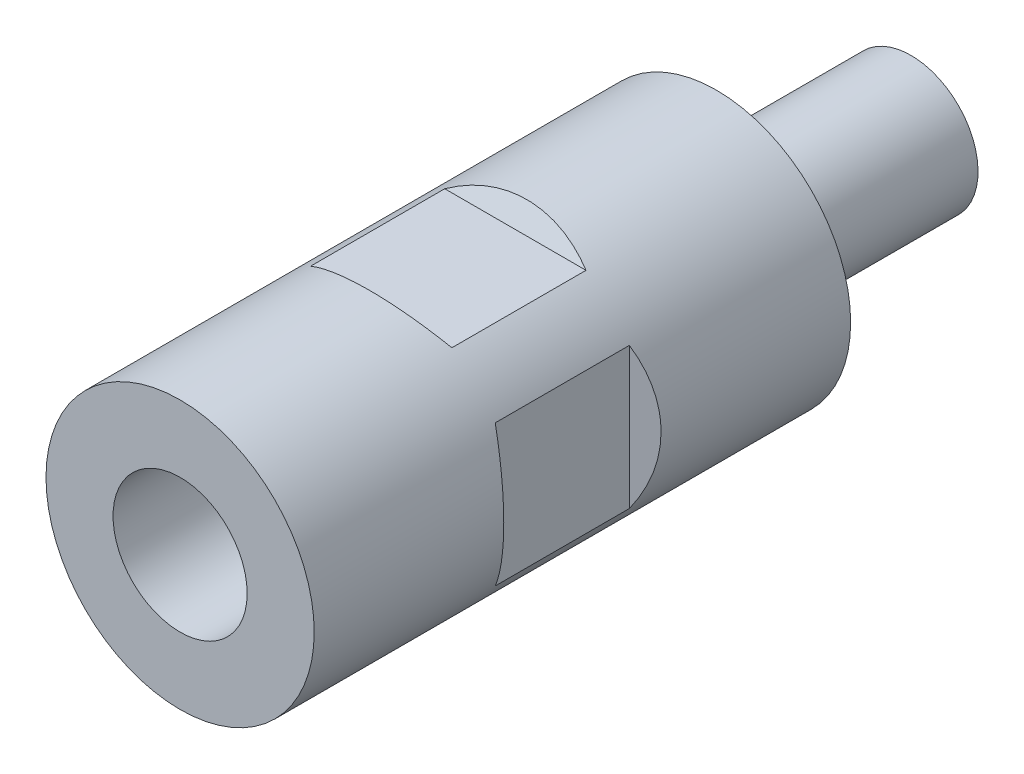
ISO-10303-21;
HEADER;
FILE_DESCRIPTION(('STEP AP214'),'2;1');
FILE_NAME('part.step','',(''),(''),'','','');
FILE_SCHEMA(('AUTOMOTIVE_DESIGN { 1 0 10303 214 1 1 1 1 }'));
ENDSEC;
DATA;
#1=APPLICATION_CONTEXT('core data for automotive mechanical design processes');
#2=APPLICATION_PROTOCOL_DEFINITION('international standard','automotive_design',2000,#1);
#3=PRODUCT_CONTEXT('',#1,'mechanical');
#4=PRODUCT('Part','Part','',(#3));
#5=PRODUCT_RELATED_PRODUCT_CATEGORY('part','',(#4));
#6=PRODUCT_DEFINITION_FORMATION('','',#4);
#7=PRODUCT_DEFINITION_CONTEXT('part definition',#1,'design');
#8=PRODUCT_DEFINITION('design','',#6,#7);
#9=PRODUCT_DEFINITION_SHAPE('','',#8);
#10=(LENGTH_UNIT() NAMED_UNIT(*) SI_UNIT(.MILLI.,.METRE.));
#11=(NAMED_UNIT(*) PLANE_ANGLE_UNIT() SI_UNIT($,.RADIAN.));
#12=(NAMED_UNIT(*) SI_UNIT($,.STERADIAN.) SOLID_ANGLE_UNIT());
#13=UNCERTAINTY_MEASURE_WITH_UNIT(LENGTH_MEASURE(1.E-05),#10,'distance_accuracy_value','');
#14=(GEOMETRIC_REPRESENTATION_CONTEXT(3) GLOBAL_UNCERTAINTY_ASSIGNED_CONTEXT((#13)) GLOBAL_UNIT_ASSIGNED_CONTEXT((#10,
#11,#12)) REPRESENTATION_CONTEXT('',''));
#15=CARTESIAN_POINT('',(0.,0.,0.));
#16=DIRECTION('',(0.,0.,1.));
#17=DIRECTION('',(1.,0.,0.));
#18=AXIS2_PLACEMENT_3D('',#15,#16,#17);
#19=CARTESIAN_POINT('',(0.,0.,-14.5));
#20=DIRECTION('',(0.,0.,1.));
#21=DIRECTION('',(0.,-1.,0.));
#22=AXIS2_PLACEMENT_3D('',#19,#20,#21);
#23=PLANE('',#22);
#24=CARTESIAN_POINT('',(0.,0.,-14.5));
#25=DIRECTION('',(0.,0.,1.));
#26=DIRECTION('',(0.,-1.,0.));
#27=AXIS2_PLACEMENT_3D('',#24,#25,#26);
#28=CIRCLE('',#27,5.);
#29=CARTESIAN_POINT('',(0.,-5.,-14.5));
#30=VERTEX_POINT('',#29);
#31=EDGE_CURVE('E103',#30,#30,#28,.F.);
#32=ORIENTED_EDGE('',*,*,#31,.T.);
#33=EDGE_LOOP('',(#32));
#34=FACE_BOUND('',#33,.T.);
#35=ADVANCED_FACE('F14',(#34),#23,.F.);
#36=CARTESIAN_POINT('',(0.,0.,5.5));
#37=DIRECTION('',(0.,0.,1.));
#38=DIRECTION('',(0.,-1.,0.));
#39=AXIS2_PLACEMENT_3D('',#36,#37,#38);
#40=CYLINDRICAL_SURFACE('',#39,5.);
#41=ORIENTED_EDGE('',*,*,#31,.F.);
#42=EDGE_LOOP('',(#41));
#43=FACE_BOUND('',#42,.T.);
#44=CARTESIAN_POINT('',(0.,4.36432032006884E-13,0.));
#45=DIRECTION('',(0.,0.,1.));
#46=DIRECTION('',(1.,0.,0.));
#47=AXIS2_PLACEMENT_3D('',#44,#45,#46);
#48=CIRCLE('',#47,5.);
#49=CARTESIAN_POINT('',(5.,4.36432032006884E-13,0.));
#50=VERTEX_POINT('',#49);
#51=EDGE_CURVE('E9',#50,#50,#48,.T.);
#52=ORIENTED_EDGE('',*,*,#51,.F.);
#53=EDGE_LOOP('',(#52));
#54=FACE_BOUND('',#53,.T.);
#55=ADVANCED_FACE('F339',(#43,#54),#40,.T.);
#56=CARTESIAN_POINT('',(0.,-5.,15.5));
#57=DIRECTION('',(0.,0.,-1.));
#58=DIRECTION('',(0.,1.,0.));
#59=AXIS2_PLACEMENT_3D('',#56,#57,#58);
#60=PLANE('',#59);
#61=CARTESIAN_POINT('',(0.,0.,15.5));
#62=DIRECTION('',(0.,0.,1.));
#63=DIRECTION('',(0.,-1.,0.));
#64=AXIS2_PLACEMENT_3D('',#61,#62,#63);
#65=CIRCLE('',#64,5.);
#66=CARTESIAN_POINT('',(0.,-5.,15.5));
#67=VERTEX_POINT('',#66);
#68=EDGE_CURVE('E17',#67,#67,#65,.T.);
#69=ORIENTED_EDGE('',*,*,#68,.T.);
#70=EDGE_LOOP('',(#69));
#71=FACE_BOUND('',#70,.T.);
#72=ADVANCED_FACE('F112',(#71),#60,.F.);
#73=CARTESIAN_POINT('',(8.5,-10.,25.));
#74=DIRECTION('',(-0.5,0.,0.86602540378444));
#75=DIRECTION('',(0.86602540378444,0.,0.5));
#76=AXIS2_PLACEMENT_3D('',#73,#74,#75);
#77=PLANE('',#76);
#78=DIRECTION('',(0.,1.,0.));
#79=VECTOR('',#78,1.);
#80=CARTESIAN_POINT('',(8.5,-10.,25.));
#81=LINE('',#80,#79);
#82=CARTESIAN_POINT('',(8.5,-5.26782687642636,25.));
#83=VERTEX_POINT('',#82);
#84=CARTESIAN_POINT('',(8.5,5.26782687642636,25.));
#85=VERTEX_POINT('',#84);
#86=EDGE_CURVE('E138',#83,#85,#81,.T.);
#87=ORIENTED_EDGE('',*,*,#86,.T.);
#88=CARTESIAN_POINT('',(0.,0.,20.0925227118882));
#89=DIRECTION('',(-0.5,0.,0.86602540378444));
#90=DIRECTION('',(-0.86602540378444,0.,-0.5));
#91=AXIS2_PLACEMENT_3D('',#88,#89,#90);
#92=ELLIPSE('',#91,11.5470053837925,10.);
#93=EDGE_CURVE('E35',#83,#85,#92,.T.);
#94=ORIENTED_EDGE('',*,*,#93,.F.);
#95=EDGE_LOOP('',(#87,#94));
#96=FACE_BOUND('',#95,.T.);
#97=ADVANCED_FACE('F204',(#96),#77,.F.);
#98=CARTESIAN_POINT('',(8.5,-10.,25.));
#99=DIRECTION('',(-1.,0.,0.));
#100=DIRECTION('',(0.,0.,1.));
#101=AXIS2_PLACEMENT_3D('',#98,#99,#100);
#102=PLANE('',#101);
#103=ORIENTED_EDGE('',*,*,#86,.F.);
#104=DIRECTION('',(0.,0.,-1.));
#105=VECTOR('',#104,1.);
#106=CARTESIAN_POINT('',(8.5,-5.26782687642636,40.));
#107=LINE('',#106,#105);
#108=CARTESIAN_POINT('',(8.5,-5.26782687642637,15.));
#109=VERTEX_POINT('',#108);
#110=EDGE_CURVE('E151',#109,#83,#107,.F.);
#111=ORIENTED_EDGE('',*,*,#110,.F.);
#112=DIRECTION('',(0.,1.,0.));
#113=VECTOR('',#112,1.);
#114=CARTESIAN_POINT('',(8.5,-10.,15.));
#115=LINE('',#114,#113);
#116=CARTESIAN_POINT('',(8.5,5.26782687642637,15.));
#117=VERTEX_POINT('',#116);
#118=EDGE_CURVE('E135',#109,#117,#115,.T.);
#119=ORIENTED_EDGE('',*,*,#118,.T.);
#120=DIRECTION('',(0.,0.,-1.));
#121=VECTOR('',#120,1.);
#122=CARTESIAN_POINT('',(8.5,5.26782687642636,40.));
#123=LINE('',#122,#121);
#124=EDGE_CURVE('E29',#85,#117,#123,.T.);
#125=ORIENTED_EDGE('',*,*,#124,.F.);
#126=EDGE_LOOP('',(#103,#111,#119,#125));
#127=FACE_BOUND('',#126,.T.);
#128=ADVANCED_FACE('F214',(#127),#102,.F.);
#129=CARTESIAN_POINT('',(8.5,-10.,15.));
#130=DIRECTION('',(-0.5,0.,-0.866025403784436));
#131=DIRECTION('',(-0.866025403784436,0.,0.5));
#132=AXIS2_PLACEMENT_3D('',#129,#130,#131);
#133=PLANE('',#132);
#134=CARTESIAN_POINT('',(0.,0.,19.9074772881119));
#135=DIRECTION('',(-0.5,0.,-0.866025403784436));
#136=DIRECTION('',(0.866025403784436,0.,-0.5));
#137=AXIS2_PLACEMENT_3D('',#134,#135,#136);
#138=ELLIPSE('',#137,11.5470053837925,10.);
#139=EDGE_CURVE('E147',#117,#109,#138,.T.);
#140=ORIENTED_EDGE('',*,*,#139,.F.);
#141=ORIENTED_EDGE('',*,*,#118,.F.);
#142=EDGE_LOOP('',(#140,#141));
#143=FACE_BOUND('',#142,.T.);
#144=ADVANCED_FACE('F215',(#143),#133,.F.);
#145=CARTESIAN_POINT('',(-8.5,-10.,15.));
#146=DIRECTION('',(0.5,0.,-0.866025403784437));
#147=DIRECTION('',(-0.866025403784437,0.,-0.5));
#148=AXIS2_PLACEMENT_3D('',#145,#146,#147);
#149=PLANE('',#148);
#150=CARTESIAN_POINT('',(0.,0.,19.9074772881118));
#151=DIRECTION('',(0.5,0.,-0.866025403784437));
#152=DIRECTION('',(-0.866025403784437,0.,-0.5));
#153=AXIS2_PLACEMENT_3D('',#150,#151,#152);
#154=ELLIPSE('',#153,11.5470053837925,10.);
#155=CARTESIAN_POINT('',(-8.5,-5.26782687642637,15.));
#156=VERTEX_POINT('',#155);
#157=CARTESIAN_POINT('',(-8.5,5.26782687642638,15.));
#158=VERTEX_POINT('',#157);
#159=EDGE_CURVE('E154',#156,#158,#154,.T.);
#160=ORIENTED_EDGE('',*,*,#159,.F.);
#161=DIRECTION('',(0.,1.,0.));
#162=VECTOR('',#161,1.);
#163=CARTESIAN_POINT('',(-8.5,-10.,15.));
#164=LINE('',#163,#162);
#165=EDGE_CURVE('E129',#156,#158,#164,.T.);
#166=ORIENTED_EDGE('',*,*,#165,.T.);
#167=EDGE_LOOP('',(#160,#166));
#168=FACE_BOUND('',#167,.T.);
#169=ADVANCED_FACE('F218',(#168),#149,.F.);
#170=CARTESIAN_POINT('',(-8.5,-10.,25.));
#171=DIRECTION('',(0.5,0.,0.86602540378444));
#172=DIRECTION('',(0.86602540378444,0.,-0.5));
#173=AXIS2_PLACEMENT_3D('',#170,#171,#172);
#174=PLANE('',#173);
#175=DIRECTION('',(0.,1.,0.));
#176=VECTOR('',#175,1.);
#177=CARTESIAN_POINT('',(-8.5,-10.,25.));
#178=LINE('',#177,#176);
#179=CARTESIAN_POINT('',(-8.5,-5.26782687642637,25.));
#180=VERTEX_POINT('',#179);
#181=CARTESIAN_POINT('',(-8.5,5.26782687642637,25.));
#182=VERTEX_POINT('',#181);
#183=EDGE_CURVE('E132',#180,#182,#178,.T.);
#184=ORIENTED_EDGE('',*,*,#183,.F.);
#185=CARTESIAN_POINT('',(0.,0.,20.0925227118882));
#186=DIRECTION('',(0.5,0.,0.86602540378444));
#187=DIRECTION('',(0.86602540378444,0.,-0.5));
#188=AXIS2_PLACEMENT_3D('',#185,#186,#187);
#189=ELLIPSE('',#188,11.5470053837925,10.);
#190=EDGE_CURVE('E162',#182,#180,#189,.T.);
#191=ORIENTED_EDGE('',*,*,#190,.F.);
#192=EDGE_LOOP('',(#184,#191));
#193=FACE_BOUND('',#192,.T.);
#194=ADVANCED_FACE('F225',(#193),#174,.F.);
#195=CARTESIAN_POINT('',(-8.5,-10.,25.));
#196=DIRECTION('',(1.,0.,0.));
#197=DIRECTION('',(0.,0.,-1.));
#198=AXIS2_PLACEMENT_3D('',#195,#196,#197);
#199=PLANE('',#198);
#200=ORIENTED_EDGE('',*,*,#183,.T.);
#201=DIRECTION('',(0.,0.,-1.));
#202=VECTOR('',#201,1.);
#203=CARTESIAN_POINT('',(-8.5,5.26782687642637,40.));
#204=LINE('',#203,#202);
#205=EDGE_CURVE('E156',#158,#182,#204,.F.);
#206=ORIENTED_EDGE('',*,*,#205,.F.);
#207=ORIENTED_EDGE('',*,*,#165,.F.);
#208=DIRECTION('',(0.,0.,-1.));
#209=VECTOR('',#208,1.);
#210=CARTESIAN_POINT('',(-8.5,-5.26782687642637,40.));
#211=LINE('',#210,#209);
#212=EDGE_CURVE('E159',#180,#156,#211,.T.);
#213=ORIENTED_EDGE('',*,*,#212,.F.);
#214=EDGE_LOOP('',(#200,#206,#207,#213));
#215=FACE_BOUND('',#214,.T.);
#216=ADVANCED_FACE('F220',(#215),#199,.F.);
#217=CARTESIAN_POINT('',(10.,8.5,25.));
#218=DIRECTION('',(0.,-0.5,0.86602540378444));
#219=DIRECTION('',(0.,-0.86602540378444,-0.5));
#220=AXIS2_PLACEMENT_3D('',#217,#218,#219);
#221=PLANE('',#220);
#222=DIRECTION('',(-1.,0.,0.));
#223=VECTOR('',#222,1.);
#224=CARTESIAN_POINT('',(10.,8.5,25.));
#225=LINE('',#224,#223);
#226=CARTESIAN_POINT('',(5.26782687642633,8.5,25.));
#227=VERTEX_POINT('',#226);
#228=CARTESIAN_POINT('',(-5.26782687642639,8.5,25.));
#229=VERTEX_POINT('',#228);
#230=EDGE_CURVE('E126',#227,#229,#225,.T.);
#231=ORIENTED_EDGE('',*,*,#230,.T.);
#232=CARTESIAN_POINT('',(0.,0.,20.0925227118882));
#233=DIRECTION('',(0.,-0.5,0.86602540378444));
#234=DIRECTION('',(0.,-0.86602540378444,-0.5));
#235=AXIS2_PLACEMENT_3D('',#232,#233,#234);
#236=ELLIPSE('',#235,11.5470053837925,10.);
#237=EDGE_CURVE('E170',#227,#229,#236,.T.);
#238=ORIENTED_EDGE('',*,*,#237,.F.);
#239=EDGE_LOOP('',(#231,#238));
#240=FACE_BOUND('',#239,.T.);
#241=ADVANCED_FACE('F191',(#240),#221,.F.);
#242=CARTESIAN_POINT('',(10.,8.5,25.));
#243=DIRECTION('',(0.,-1.,0.));
#244=DIRECTION('',(1.,0.,0.));
#245=AXIS2_PLACEMENT_3D('',#242,#243,#244);
#246=PLANE('',#245);
#247=ORIENTED_EDGE('',*,*,#230,.F.);
#248=DIRECTION('',(0.,0.,-1.));
#249=VECTOR('',#248,1.);
#250=CARTESIAN_POINT('',(5.26782687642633,8.5,40.));
#251=LINE('',#250,#249);
#252=CARTESIAN_POINT('',(5.26782687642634,8.5,15.));
#253=VERTEX_POINT('',#252);
#254=EDGE_CURVE('E88',#253,#227,#251,.F.);
#255=ORIENTED_EDGE('',*,*,#254,.F.);
#256=DIRECTION('',(-1.,0.,0.));
#257=VECTOR('',#256,1.);
#258=CARTESIAN_POINT('',(10.,8.5,15.));
#259=LINE('',#258,#257);
#260=CARTESIAN_POINT('',(-5.26782687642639,8.5,15.));
#261=VERTEX_POINT('',#260);
#262=EDGE_CURVE('E124',#253,#261,#259,.T.);
#263=ORIENTED_EDGE('',*,*,#262,.T.);
#264=DIRECTION('',(0.,0.,-1.));
#265=VECTOR('',#264,1.);
#266=CARTESIAN_POINT('',(-5.26782687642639,8.5,40.));
#267=LINE('',#266,#265);
#268=EDGE_CURVE('E167',#229,#261,#267,.T.);
#269=ORIENTED_EDGE('',*,*,#268,.F.);
#270=EDGE_LOOP('',(#247,#255,#263,#269));
#271=FACE_BOUND('',#270,.T.);
#272=ADVANCED_FACE('F179',(#271),#246,.F.);
#273=CARTESIAN_POINT('',(10.,8.5,15.));
#274=DIRECTION('',(0.,-0.5,-0.866025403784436));
#275=DIRECTION('',(0.,0.866025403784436,-0.5));
#276=AXIS2_PLACEMENT_3D('',#273,#274,#275);
#277=PLANE('',#276);
#278=CARTESIAN_POINT('',(0.,0.,19.9074772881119));
#279=DIRECTION('',(0.,-0.5,-0.866025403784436));
#280=DIRECTION('',(0.,0.866025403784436,-0.5));
#281=AXIS2_PLACEMENT_3D('',#278,#279,#280);
#282=ELLIPSE('',#281,11.5470053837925,10.);
#283=EDGE_CURVE('E165',#261,#253,#282,.T.);
#284=ORIENTED_EDGE('',*,*,#283,.F.);
#285=ORIENTED_EDGE('',*,*,#262,.F.);
#286=EDGE_LOOP('',(#284,#285));
#287=FACE_BOUND('',#286,.T.);
#288=ADVANCED_FACE('F181',(#287),#277,.F.);
#289=CARTESIAN_POINT('',(10.,-8.5,15.));
#290=DIRECTION('',(0.,0.5,-0.866025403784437));
#291=DIRECTION('',(0.,0.866025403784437,0.5));
#292=AXIS2_PLACEMENT_3D('',#289,#290,#291);
#293=PLANE('',#292);
#294=CARTESIAN_POINT('',(0.,0.,19.9074772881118));
#295=DIRECTION('',(0.,0.5,-0.866025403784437));
#296=DIRECTION('',(0.,-0.866025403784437,-0.5));
#297=AXIS2_PLACEMENT_3D('',#294,#295,#296);
#298=ELLIPSE('',#297,11.5470053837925,10.);
#299=CARTESIAN_POINT('',(5.26782687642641,-8.5,15.));
#300=VERTEX_POINT('',#299);
#301=CARTESIAN_POINT('',(-5.26782687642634,-8.5,15.));
#302=VERTEX_POINT('',#301);
#303=EDGE_CURVE('E79',#300,#302,#298,.T.);
#304=ORIENTED_EDGE('',*,*,#303,.F.);
#305=DIRECTION('',(-1.,0.,0.));
#306=VECTOR('',#305,1.);
#307=CARTESIAN_POINT('',(10.,-8.5,15.));
#308=LINE('',#307,#306);
#309=EDGE_CURVE('E82',#300,#302,#308,.T.);
#310=ORIENTED_EDGE('',*,*,#309,.T.);
#311=EDGE_LOOP('',(#304,#310));
#312=FACE_BOUND('',#311,.T.);
#313=ADVANCED_FACE('F81',(#312),#293,.F.);
#314=CARTESIAN_POINT('',(10.,-8.5,25.));
#315=DIRECTION('',(0.,0.5,0.86602540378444));
#316=DIRECTION('',(0.,-0.86602540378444,0.5));
#317=AXIS2_PLACEMENT_3D('',#314,#315,#316);
#318=PLANE('',#317);
#319=DIRECTION('',(-1.,0.,0.));
#320=VECTOR('',#319,1.);
#321=CARTESIAN_POINT('',(10.,-8.5,25.));
#322=LINE('',#321,#320);
#323=CARTESIAN_POINT('',(5.26782687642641,-8.5,25.));
#324=VERTEX_POINT('',#323);
#325=CARTESIAN_POINT('',(-5.26782687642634,-8.5,25.));
#326=VERTEX_POINT('',#325);
#327=EDGE_CURVE('E95',#324,#326,#322,.T.);
#328=ORIENTED_EDGE('',*,*,#327,.F.);
#329=CARTESIAN_POINT('',(0.,0.,20.0925227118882));
#330=DIRECTION('',(0.,0.5,0.86602540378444));
#331=DIRECTION('',(0.,0.86602540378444,-0.5));
#332=AXIS2_PLACEMENT_3D('',#329,#330,#331);
#333=ELLIPSE('',#332,11.5470053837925,10.);
#334=EDGE_CURVE('E101',#326,#324,#333,.T.);
#335=ORIENTED_EDGE('',*,*,#334,.F.);
#336=EDGE_LOOP('',(#328,#335));
#337=FACE_BOUND('',#336,.T.);
#338=ADVANCED_FACE('F189',(#337),#318,.F.);
#339=CARTESIAN_POINT('',(10.,-8.5,25.));
#340=DIRECTION('',(0.,1.,0.));
#341=DIRECTION('',(-1.,0.,0.));
#342=AXIS2_PLACEMENT_3D('',#339,#340,#341);
#343=PLANE('',#342);
#344=ORIENTED_EDGE('',*,*,#327,.T.);
#345=DIRECTION('',(0.,0.,-1.));
#346=VECTOR('',#345,1.);
#347=CARTESIAN_POINT('',(-5.26782687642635,-8.5,40.));
#348=LINE('',#347,#346);
#349=EDGE_CURVE('E87',#302,#326,#348,.F.);
#350=ORIENTED_EDGE('',*,*,#349,.F.);
#351=ORIENTED_EDGE('',*,*,#309,.F.);
#352=DIRECTION('',(0.,0.,-1.));
#353=VECTOR('',#352,1.);
#354=CARTESIAN_POINT('',(5.26782687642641,-8.5,40.));
#355=LINE('',#354,#353);
#356=EDGE_CURVE('E93',#324,#300,#355,.T.);
#357=ORIENTED_EDGE('',*,*,#356,.F.);
#358=EDGE_LOOP('',(#344,#350,#351,#357));
#359=FACE_BOUND('',#358,.T.);
#360=ADVANCED_FACE('F92',(#359),#343,.F.);
#361=CARTESIAN_POINT('',(0.,0.,40.));
#362=DIRECTION('',(0.,0.,-1.));
#363=DIRECTION('',(-1.,0.,0.));
#364=AXIS2_PLACEMENT_3D('',#361,#362,#363);
#365=CYLINDRICAL_SURFACE('',#364,10.);
#366=ORIENTED_EDGE('',*,*,#349,.T.);
#367=ORIENTED_EDGE('',*,*,#334,.T.);
#368=ORIENTED_EDGE('',*,*,#356,.T.);
#369=ORIENTED_EDGE('',*,*,#303,.T.);
#370=EDGE_LOOP('',(#366,#367,#368,#369));
#371=FACE_BOUND('',#370,.T.);
#372=ORIENTED_EDGE('',*,*,#283,.T.);
#373=ORIENTED_EDGE('',*,*,#254,.T.);
#374=ORIENTED_EDGE('',*,*,#237,.T.);
#375=ORIENTED_EDGE('',*,*,#268,.T.);
#376=EDGE_LOOP('',(#372,#373,#374,#375));
#377=FACE_BOUND('',#376,.T.);
#378=ORIENTED_EDGE('',*,*,#205,.T.);
#379=ORIENTED_EDGE('',*,*,#190,.T.);
#380=ORIENTED_EDGE('',*,*,#212,.T.);
#381=ORIENTED_EDGE('',*,*,#159,.T.);
#382=EDGE_LOOP('',(#378,#379,#380,#381));
#383=FACE_BOUND('',#382,.T.);
#384=ORIENTED_EDGE('',*,*,#139,.T.);
#385=ORIENTED_EDGE('',*,*,#110,.T.);
#386=ORIENTED_EDGE('',*,*,#93,.T.);
#387=ORIENTED_EDGE('',*,*,#124,.T.);
#388=EDGE_LOOP('',(#384,#385,#386,#387));
#389=FACE_BOUND('',#388,.T.);
#390=CARTESIAN_POINT('',(0.,0.,40.));
#391=DIRECTION('',(0.,0.,1.));
#392=DIRECTION('',(1.,0.,0.));
#393=AXIS2_PLACEMENT_3D('',#390,#391,#392);
#394=CIRCLE('',#393,10.);
#395=CARTESIAN_POINT('',(10.,0.,40.));
#396=VERTEX_POINT('',#395);
#397=EDGE_CURVE('E144',#396,#396,#394,.T.);
#398=ORIENTED_EDGE('',*,*,#397,.F.);
#399=EDGE_LOOP('',(#398));
#400=FACE_BOUND('',#399,.T.);
#401=CARTESIAN_POINT('',(0.,0.,0.));
#402=DIRECTION('',(0.,0.,1.));
#403=DIRECTION('',(1.,0.,0.));
#404=AXIS2_PLACEMENT_3D('',#401,#402,#403);
#405=CIRCLE('',#404,10.);
#406=CARTESIAN_POINT('',(10.,0.,0.));
#407=VERTEX_POINT('',#406);
#408=EDGE_CURVE('E140',#407,#407,#405,.T.);
#409=ORIENTED_EDGE('',*,*,#408,.T.);
#410=EDGE_LOOP('',(#409));
#411=FACE_BOUND('',#410,.T.);
#412=ADVANCED_FACE('F99',(#371,#377,#383,#389,#400,#411),#365,.T.);
#413=CARTESIAN_POINT('',(0.,0.,0.));
#414=DIRECTION('',(0.,0.,1.));
#415=DIRECTION('',(1.,0.,0.));
#416=AXIS2_PLACEMENT_3D('',#413,#414,#415);
#417=PLANE('',#416);
#418=ORIENTED_EDGE('',*,*,#51,.T.);
#419=EDGE_LOOP('',(#418));
#420=FACE_BOUND('',#419,.T.);
#421=ORIENTED_EDGE('',*,*,#408,.F.);
#422=EDGE_LOOP('',(#421));
#423=FACE_BOUND('',#422,.T.);
#424=ADVANCED_FACE('F197',(#420,#423),#417,.F.);
#425=CARTESIAN_POINT('',(0.,0.,40.));
#426=DIRECTION('',(0.,0.,1.));
#427=DIRECTION('',(1.,0.,0.));
#428=AXIS2_PLACEMENT_3D('',#425,#426,#427);
#429=PLANE('',#428);
#430=CARTESIAN_POINT('',(0.,4.36432032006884E-13,40.));
#431=DIRECTION('',(0.,0.,1.));
#432=DIRECTION('',(1.,0.,0.));
#433=AXIS2_PLACEMENT_3D('',#430,#431,#432);
#434=CIRCLE('',#433,5.);
#435=CARTESIAN_POINT('',(5.,4.36432032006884E-13,40.));
#436=VERTEX_POINT('',#435);
#437=EDGE_CURVE('E96',#436,#436,#434,.T.);
#438=ORIENTED_EDGE('',*,*,#437,.F.);
#439=EDGE_LOOP('',(#438));
#440=FACE_BOUND('',#439,.T.);
#441=ORIENTED_EDGE('',*,*,#397,.T.);
#442=EDGE_LOOP('',(#441));
#443=FACE_BOUND('',#442,.T.);
#444=ADVANCED_FACE('F117',(#440,#443),#429,.T.);
#445=CARTESIAN_POINT('',(0.,4.36432032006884E-13,40.));
#446=DIRECTION('',(0.,0.,1.));
#447=DIRECTION('',(1.,0.,0.));
#448=AXIS2_PLACEMENT_3D('',#445,#446,#447);
#449=CYLINDRICAL_SURFACE('',#448,5.);
#450=ORIENTED_EDGE('',*,*,#68,.F.);
#451=EDGE_LOOP('',(#450));
#452=FACE_BOUND('',#451,.T.);
#453=ORIENTED_EDGE('',*,*,#437,.T.);
#454=EDGE_LOOP('',(#453));
#455=FACE_BOUND('',#454,.T.);
#456=ADVANCED_FACE('F114',(#452,#455),#449,.F.);
#457=CLOSED_SHELL('',(#35,#55,#72,#97,#128,#144,#169,#194,#216,#241,#272,#288,#313,#338,#360,
#412,#424,#444,#456));
#458=MANIFOLD_SOLID_BREP('B1',#457);
#459=ADVANCED_BREP_SHAPE_REPRESENTATION('',(#18,#458),#14);
#460=SHAPE_DEFINITION_REPRESENTATION(#9,#459);
ENDSEC;
END-ISO-10303-21;
